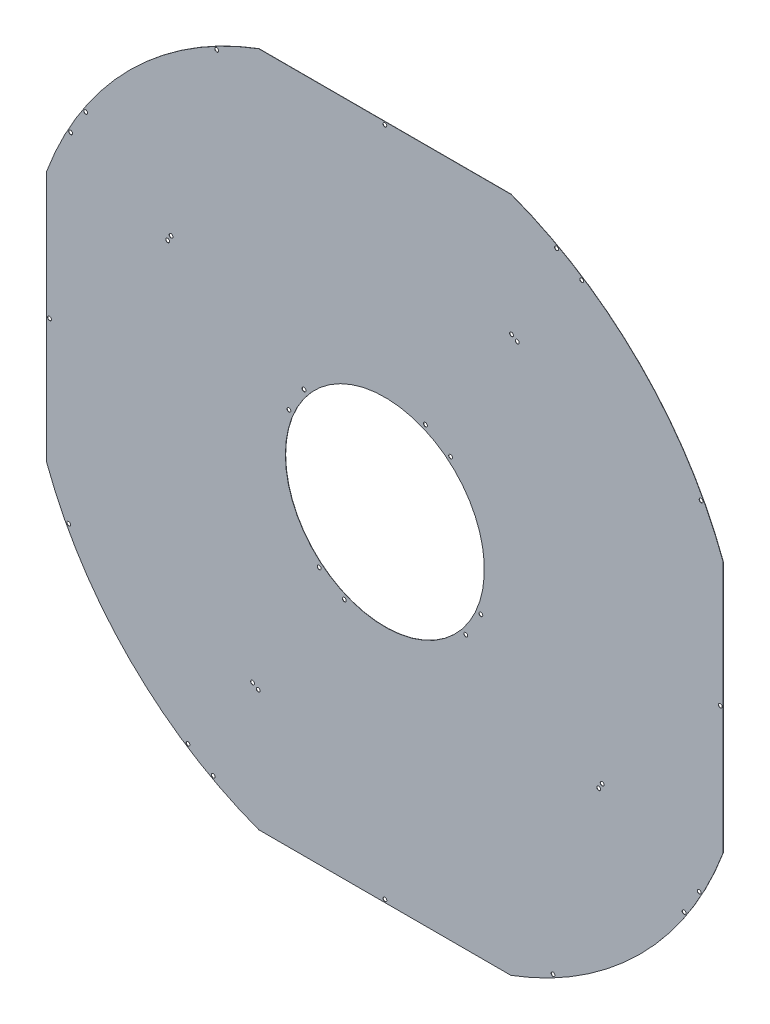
ISO-10303-21;
HEADER;
FILE_DESCRIPTION(('STEP AP214'),'2;1');
FILE_NAME('part.step','',(''),(''),'','','');
FILE_SCHEMA(('AUTOMOTIVE_DESIGN { 1 0 10303 214 1 1 1 1 }'));
ENDSEC;
DATA;
#1=APPLICATION_CONTEXT('core data for automotive mechanical design processes');
#2=APPLICATION_PROTOCOL_DEFINITION('international standard','automotive_design',2000,#1);
#3=PRODUCT_CONTEXT('',#1,'mechanical');
#4=PRODUCT('Part','Part','',(#3));
#5=PRODUCT_RELATED_PRODUCT_CATEGORY('part','',(#4));
#6=PRODUCT_DEFINITION_FORMATION('','',#4);
#7=PRODUCT_DEFINITION_CONTEXT('part definition',#1,'design');
#8=PRODUCT_DEFINITION('design','',#6,#7);
#9=PRODUCT_DEFINITION_SHAPE('','',#8);
#10=(LENGTH_UNIT() NAMED_UNIT(*) SI_UNIT(.MILLI.,.METRE.));
#11=(NAMED_UNIT(*) PLANE_ANGLE_UNIT() SI_UNIT($,.RADIAN.));
#12=(NAMED_UNIT(*) SI_UNIT($,.STERADIAN.) SOLID_ANGLE_UNIT());
#13=UNCERTAINTY_MEASURE_WITH_UNIT(LENGTH_MEASURE(1.E-05),#10,'distance_accuracy_value','');
#14=(GEOMETRIC_REPRESENTATION_CONTEXT(3) GLOBAL_UNCERTAINTY_ASSIGNED_CONTEXT((#13)) GLOBAL_UNIT_ASSIGNED_CONTEXT((#10,
#11,#12)) REPRESENTATION_CONTEXT('',''));
#15=CARTESIAN_POINT('',(0.,0.,0.));
#16=DIRECTION('',(0.,0.,1.));
#17=DIRECTION('',(1.,0.,0.));
#18=AXIS2_PLACEMENT_3D('',#15,#16,#17);
#19=CARTESIAN_POINT('',(0.,0.,0.25));
#20=DIRECTION('',(0.,0.,-1.));
#21=DIRECTION('',(-1.,0.,0.));
#22=AXIS2_PLACEMENT_3D('',#19,#20,#21);
#23=CYLINDRICAL_SURFACE('',#22,381.);
#24=CARTESIAN_POINT('',(0.,0.,0.));
#25=DIRECTION('',(0.,0.,1.));
#26=DIRECTION('',(-1.,0.,0.));
#27=AXIS2_PLACEMENT_3D('',#24,#25,#26);
#28=CIRCLE('',#27,381.);
#29=CARTESIAN_POINT('',(357.000000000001,133.086438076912,0.));
#30=VERTEX_POINT('',#29);
#31=CARTESIAN_POINT('',(133.086438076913,357.,0.));
#32=VERTEX_POINT('',#31);
#33=EDGE_CURVE('E75',#30,#32,#28,.T.);
#34=ORIENTED_EDGE('',*,*,#33,.T.);
#35=DIRECTION('',(0.,0.,-1.));
#36=VECTOR('',#35,1.);
#37=CARTESIAN_POINT('',(133.086438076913,357.,0.25));
#38=LINE('',#37,#36);
#39=CARTESIAN_POINT('',(133.086438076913,357.,0.25));
#40=VERTEX_POINT('',#39);
#41=EDGE_CURVE('E11',#40,#32,#38,.T.);
#42=ORIENTED_EDGE('',*,*,#41,.F.);
#43=CARTESIAN_POINT('',(0.,0.,0.25));
#44=DIRECTION('',(0.,0.,1.));
#45=DIRECTION('',(-1.,0.,0.));
#46=AXIS2_PLACEMENT_3D('',#43,#44,#45);
#47=CIRCLE('',#46,381.);
#48=CARTESIAN_POINT('',(357.000000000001,133.086438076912,0.25));
#49=VERTEX_POINT('',#48);
#50=EDGE_CURVE('E64',#49,#40,#47,.T.);
#51=ORIENTED_EDGE('',*,*,#50,.F.);
#52=DIRECTION('',(0.,0.,-1.));
#53=VECTOR('',#52,1.);
#54=CARTESIAN_POINT('',(357.000000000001,133.086438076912,0.25));
#55=LINE('',#54,#53);
#56=EDGE_CURVE('E87',#49,#30,#55,.T.);
#57=ORIENTED_EDGE('',*,*,#56,.T.);
#58=EDGE_LOOP('',(#34,#42,#51,#57));
#59=FACE_BOUND('',#58,.T.);
#60=ADVANCED_FACE('F30',(#59),#23,.T.);
#61=CARTESIAN_POINT('',(133.086438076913,357.,0.25));
#62=DIRECTION('',(0.,-1.,0.));
#63=DIRECTION('',(1.,0.,0.));
#64=AXIS2_PLACEMENT_3D('',#61,#62,#63);
#65=PLANE('',#64);
#66=DIRECTION('',(-1.,0.,0.));
#67=VECTOR('',#66,1.);
#68=CARTESIAN_POINT('',(133.086438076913,357.,0.));
#69=LINE('',#68,#67);
#70=CARTESIAN_POINT('',(-133.086438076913,357.,0.));
#71=VERTEX_POINT('',#70);
#72=EDGE_CURVE('E57',#32,#71,#69,.T.);
#73=ORIENTED_EDGE('',*,*,#72,.T.);
#74=DIRECTION('',(0.,0.,-1.));
#75=VECTOR('',#74,1.);
#76=CARTESIAN_POINT('',(-133.086438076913,357.,0.25));
#77=LINE('',#76,#75);
#78=CARTESIAN_POINT('',(-133.086438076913,357.,0.25));
#79=VERTEX_POINT('',#78);
#80=EDGE_CURVE('E38',#79,#71,#77,.T.);
#81=ORIENTED_EDGE('',*,*,#80,.F.);
#82=DIRECTION('',(-1.,0.,0.));
#83=VECTOR('',#82,1.);
#84=CARTESIAN_POINT('',(133.086438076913,357.,0.25));
#85=LINE('',#84,#83);
#86=EDGE_CURVE('E46',#40,#79,#85,.T.);
#87=ORIENTED_EDGE('',*,*,#86,.F.);
#88=ORIENTED_EDGE('',*,*,#41,.T.);
#89=EDGE_LOOP('',(#73,#81,#87,#88));
#90=FACE_BOUND('',#89,.T.);
#91=ADVANCED_FACE('F452',(#90),#65,.F.);
#92=CARTESIAN_POINT('',(0.,0.,0.25));
#93=DIRECTION('',(0.,0.,-1.));
#94=DIRECTION('',(-1.,0.,0.));
#95=AXIS2_PLACEMENT_3D('',#92,#93,#94);
#96=CYLINDRICAL_SURFACE('',#95,381.);
#97=CARTESIAN_POINT('',(0.,0.,0.));
#98=DIRECTION('',(0.,0.,1.));
#99=DIRECTION('',(-1.,0.,0.));
#100=AXIS2_PLACEMENT_3D('',#97,#98,#99);
#101=CIRCLE('',#100,381.);
#102=CARTESIAN_POINT('',(-356.999999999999,133.086438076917,0.));
#103=VERTEX_POINT('',#102);
#104=EDGE_CURVE('E156',#71,#103,#101,.T.);
#105=ORIENTED_EDGE('',*,*,#104,.T.);
#106=DIRECTION('',(0.,0.,-1.));
#107=VECTOR('',#106,1.);
#108=CARTESIAN_POINT('',(-356.999999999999,133.086438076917,0.25));
#109=LINE('',#108,#107);
#110=CARTESIAN_POINT('',(-356.999999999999,133.086438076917,0.25));
#111=VERTEX_POINT('',#110);
#112=EDGE_CURVE('E184',#111,#103,#109,.T.);
#113=ORIENTED_EDGE('',*,*,#112,.F.);
#114=CARTESIAN_POINT('',(0.,0.,0.25));
#115=DIRECTION('',(0.,0.,1.));
#116=DIRECTION('',(-1.,0.,0.));
#117=AXIS2_PLACEMENT_3D('',#114,#115,#116);
#118=CIRCLE('',#117,381.);
#119=EDGE_CURVE('E150',#79,#111,#118,.T.);
#120=ORIENTED_EDGE('',*,*,#119,.F.);
#121=ORIENTED_EDGE('',*,*,#80,.T.);
#122=EDGE_LOOP('',(#105,#113,#120,#121));
#123=FACE_BOUND('',#122,.T.);
#124=ADVANCED_FACE('F163',(#123),#96,.T.);
#125=CARTESIAN_POINT('',(0.,0.,0.25));
#126=DIRECTION('',(0.,0.,-1.));
#127=DIRECTION('',(-1.,0.,0.));
#128=AXIS2_PLACEMENT_3D('',#125,#126,#127);
#129=CYLINDRICAL_SURFACE('',#128,105.);
#130=CARTESIAN_POINT('',(0.,0.,0.));
#131=DIRECTION('',(0.,0.,-1.));
#132=DIRECTION('',(-1.,0.,0.));
#133=AXIS2_PLACEMENT_3D('',#130,#131,#132);
#134=CIRCLE('',#133,105.);
#135=CARTESIAN_POINT('',(-105.,0.,0.));
#136=VERTEX_POINT('',#135);
#137=EDGE_CURVE('E148',#136,#136,#134,.T.);
#138=ORIENTED_EDGE('',*,*,#137,.T.);
#139=EDGE_LOOP('',(#138));
#140=FACE_BOUND('',#139,.T.);
#141=CARTESIAN_POINT('',(0.,0.,0.25));
#142=DIRECTION('',(0.,0.,-1.));
#143=DIRECTION('',(-1.,0.,0.));
#144=AXIS2_PLACEMENT_3D('',#141,#142,#143);
#145=CIRCLE('',#144,105.);
#146=CARTESIAN_POINT('',(-105.,0.,0.25));
#147=VERTEX_POINT('',#146);
#148=EDGE_CURVE('E152',#147,#147,#145,.T.);
#149=ORIENTED_EDGE('',*,*,#148,.F.);
#150=EDGE_LOOP('',(#149));
#151=FACE_BOUND('',#150,.T.);
#152=ADVANCED_FACE('F389',(#140,#151),#129,.F.);
#153=CARTESIAN_POINT('',(0.,0.,0.25));
#154=DIRECTION('',(0.,0.,-1.));
#155=DIRECTION('',(-1.,0.,0.));
#156=AXIS2_PLACEMENT_3D('',#153,#154,#155);
#157=PLANE('',#156);
#158=CARTESIAN_POINT('',(-139.694756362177,-225.695502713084,0.25));
#159=DIRECTION('',(0.,0.,1.));
#160=DIRECTION('',(0.,1.,0.));
#161=AXIS2_PLACEMENT_3D('',#158,#159,#160);
#162=CIRCLE('',#161,2.);
#163=CARTESIAN_POINT('',(-139.694756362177,-223.695502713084,0.25));
#164=VERTEX_POINT('',#163);
#165=EDGE_CURVE('E372',#164,#164,#162,.T.);
#166=ORIENTED_EDGE('',*,*,#165,.F.);
#167=EDGE_LOOP('',(#166));
#168=FACE_BOUND('',#167,.T.);
#169=CARTESIAN_POINT('',(-229.300769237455,133.694585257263,0.25));
#170=DIRECTION('',(0.,0.,1.));
#171=DIRECTION('',(0.,1.,0.));
#172=AXIS2_PLACEMENT_3D('',#169,#170,#171);
#173=CIRCLE('',#172,1.99999999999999);
#174=CARTESIAN_POINT('',(-229.300769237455,135.694585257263,0.25));
#175=VERTEX_POINT('',#174);
#176=EDGE_CURVE('E366',#175,#175,#173,.T.);
#177=ORIENTED_EDGE('',*,*,#176,.F.);
#178=EDGE_LOOP('',(#177));
#179=FACE_BOUND('',#178,.T.);
#180=CARTESIAN_POINT('',(-331.719815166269,181.23455582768,0.25));
#181=DIRECTION('',(0.,0.,1.));
#182=DIRECTION('',(0.,1.,0.));
#183=AXIS2_PLACEMENT_3D('',#180,#181,#182);
#184=CIRCLE('',#183,1.99999999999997);
#185=CARTESIAN_POINT('',(-331.719815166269,183.23455582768,0.25));
#186=VERTEX_POINT('',#185);
#187=EDGE_CURVE('E360',#186,#186,#184,.T.);
#188=ORIENTED_EDGE('',*,*,#187,.F.);
#189=EDGE_LOOP('',(#188));
#190=FACE_BOUND('',#189,.T.);
#191=CARTESIAN_POINT('',(-101.330734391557,42.8028301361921,0.25));
#192=DIRECTION('',(0.,0.,1.));
#193=DIRECTION('',(0.,1.,0.));
#194=AXIS2_PLACEMENT_3D('',#191,#192,#193);
#195=CIRCLE('',#194,2.);
#196=CARTESIAN_POINT('',(-101.330734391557,44.8028301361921,0.25));
#197=VERTEX_POINT('',#196);
#198=EDGE_CURVE('E354',#197,#197,#195,.T.);
#199=ORIENTED_EDGE('',*,*,#198,.F.);
#200=EDGE_LOOP('',(#199));
#201=FACE_BOUND('',#200,.T.);
#202=CARTESIAN_POINT('',(-354.,3.65244203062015E-12,0.25));
#203=DIRECTION('',(0.,0.,1.));
#204=DIRECTION('',(0.,1.,0.));
#205=AXIS2_PLACEMENT_3D('',#202,#203,#204);
#206=CIRCLE('',#205,1.99999999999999);
#207=CARTESIAN_POINT('',(-354.,2.00000000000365,0.25));
#208=VERTEX_POINT('',#207);
#209=EDGE_CURVE('E348',#208,#208,#206,.T.);
#210=ORIENTED_EDGE('',*,*,#209,.F.);
#211=EDGE_LOOP('',(#210));
#212=FACE_BOUND('',#211,.T.);
#213=CARTESIAN_POINT('',(-69.3750164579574,-85.3645540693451,0.25));
#214=DIRECTION('',(0.,0.,1.));
#215=DIRECTION('',(0.,1.,0.));
#216=AXIS2_PLACEMENT_3D('',#213,#214,#215);
#217=CIRCLE('',#216,2.00000000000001);
#218=CARTESIAN_POINT('',(-69.3750164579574,-83.3645540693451,0.25));
#219=VERTEX_POINT('',#218);
#220=EDGE_CURVE('E342',#219,#219,#217,.T.);
#221=ORIENTED_EDGE('',*,*,#220,.F.);
#222=EDGE_LOOP('',(#221));
#223=FACE_BOUND('',#222,.T.);
#224=CARTESIAN_POINT('',(-333.754190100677,-177.460250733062,0.25));
#225=DIRECTION('',(0.,0.,1.));
#226=DIRECTION('',(0.,1.,0.));
#227=AXIS2_PLACEMENT_3D('',#224,#225,#226);
#228=CIRCLE('',#227,1.99999999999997);
#229=CARTESIAN_POINT('',(-333.754190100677,-175.460250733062,0.25));
#230=VERTEX_POINT('',#229);
#231=EDGE_CURVE('E336',#230,#230,#228,.T.);
#232=ORIENTED_EDGE('',*,*,#231,.F.);
#233=EDGE_LOOP('',(#232));
#234=FACE_BOUND('',#233,.T.);
#235=CARTESIAN_POINT('',(-207.806742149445,-315.753634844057,0.25));
#236=DIRECTION('',(0.,0.,1.));
#237=DIRECTION('',(0.,1.,0.));
#238=AXIS2_PLACEMENT_3D('',#235,#236,#237);
#239=CIRCLE('',#238,1.99999999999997);
#240=CARTESIAN_POINT('',(-207.806742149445,-313.753634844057,0.25));
#241=VERTEX_POINT('',#240);
#242=EDGE_CURVE('E330',#241,#241,#239,.T.);
#243=ORIENTED_EDGE('',*,*,#242,.F.);
#244=EDGE_LOOP('',(#243));
#245=FACE_BOUND('',#244,.T.);
#246=CARTESIAN_POINT('',(225.695502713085,-139.694756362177,0.25));
#247=DIRECTION('',(0.,0.,1.));
#248=DIRECTION('',(-1.,0.,0.));
#249=AXIS2_PLACEMENT_3D('',#246,#247,#248);
#250=CIRCLE('',#249,2.);
#251=CARTESIAN_POINT('',(223.695502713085,-139.694756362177,0.25));
#252=VERTEX_POINT('',#251);
#253=EDGE_CURVE('E324',#252,#252,#250,.T.);
#254=ORIENTED_EDGE('',*,*,#253,.F.);
#255=EDGE_LOOP('',(#254));
#256=FACE_BOUND('',#255,.T.);
#257=CARTESIAN_POINT('',(-133.694585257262,-229.300769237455,0.25));
#258=DIRECTION('',(0.,0.,1.));
#259=DIRECTION('',(-1.,0.,0.));
#260=AXIS2_PLACEMENT_3D('',#257,#258,#259);
#261=CIRCLE('',#260,1.99999999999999);
#262=CARTESIAN_POINT('',(-135.694585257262,-229.300769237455,0.25));
#263=VERTEX_POINT('',#262);
#264=EDGE_CURVE('E318',#263,#263,#261,.T.);
#265=ORIENTED_EDGE('',*,*,#264,.F.);
#266=EDGE_LOOP('',(#265));
#267=FACE_BOUND('',#266,.T.);
#268=CARTESIAN_POINT('',(-181.234555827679,-331.71981516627,0.25));
#269=DIRECTION('',(0.,0.,1.));
#270=DIRECTION('',(-1.,0.,0.));
#271=AXIS2_PLACEMENT_3D('',#268,#269,#270);
#272=CIRCLE('',#271,1.99999999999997);
#273=CARTESIAN_POINT('',(-183.234555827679,-331.71981516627,0.25));
#274=VERTEX_POINT('',#273);
#275=EDGE_CURVE('E312',#274,#274,#272,.T.);
#276=ORIENTED_EDGE('',*,*,#275,.F.);
#277=EDGE_LOOP('',(#276));
#278=FACE_BOUND('',#277,.T.);
#279=CARTESIAN_POINT('',(-42.8028301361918,-101.330734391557,0.25));
#280=DIRECTION('',(0.,0.,1.));
#281=DIRECTION('',(-1.,0.,0.));
#282=AXIS2_PLACEMENT_3D('',#279,#280,#281);
#283=CIRCLE('',#282,2.);
#284=CARTESIAN_POINT('',(-44.8028301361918,-101.330734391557,0.25));
#285=VERTEX_POINT('',#284);
#286=EDGE_CURVE('E306',#285,#285,#283,.T.);
#287=ORIENTED_EDGE('',*,*,#286,.F.);
#288=EDGE_LOOP('',(#287));
#289=FACE_BOUND('',#288,.T.);
#290=CARTESIAN_POINT('',(-2.41645763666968E-12,-354.,0.25));
#291=DIRECTION('',(0.,0.,1.));
#292=DIRECTION('',(-1.,0.,0.));
#293=AXIS2_PLACEMENT_3D('',#290,#291,#292);
#294=CIRCLE('',#293,1.99999999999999);
#295=CARTESIAN_POINT('',(-2.00000000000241,-354.,0.25));
#296=VERTEX_POINT('',#295);
#297=EDGE_CURVE('E300',#296,#296,#294,.T.);
#298=ORIENTED_EDGE('',*,*,#297,.F.);
#299=EDGE_LOOP('',(#298));
#300=FACE_BOUND('',#299,.T.);
#301=CARTESIAN_POINT('',(85.3645540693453,-69.3750164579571,0.25));
#302=DIRECTION('',(0.,0.,1.));
#303=DIRECTION('',(-1.,0.,0.));
#304=AXIS2_PLACEMENT_3D('',#301,#302,#303);
#305=CIRCLE('',#304,2.00000000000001);
#306=CARTESIAN_POINT('',(83.3645540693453,-69.3750164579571,0.25));
#307=VERTEX_POINT('',#306);
#308=EDGE_CURVE('E294',#307,#307,#305,.T.);
#309=ORIENTED_EDGE('',*,*,#308,.F.);
#310=EDGE_LOOP('',(#309));
#311=FACE_BOUND('',#310,.T.);
#312=CARTESIAN_POINT('',(177.460250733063,-333.754190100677,0.25));
#313=DIRECTION('',(0.,0.,1.));
#314=DIRECTION('',(-1.,0.,0.));
#315=AXIS2_PLACEMENT_3D('',#312,#313,#314);
#316=CIRCLE('',#315,1.99999999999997);
#317=CARTESIAN_POINT('',(175.460250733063,-333.754190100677,0.25));
#318=VERTEX_POINT('',#317);
#319=EDGE_CURVE('E288',#318,#318,#316,.T.);
#320=ORIENTED_EDGE('',*,*,#319,.F.);
#321=EDGE_LOOP('',(#320));
#322=FACE_BOUND('',#321,.T.);
#323=CARTESIAN_POINT('',(315.753634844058,-207.806742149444,0.25));
#324=DIRECTION('',(0.,0.,1.));
#325=DIRECTION('',(-1.,0.,0.));
#326=AXIS2_PLACEMENT_3D('',#323,#324,#325);
#327=CIRCLE('',#326,1.99999999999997);
#328=CARTESIAN_POINT('',(313.753634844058,-207.806742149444,0.25));
#329=VERTEX_POINT('',#328);
#330=EDGE_CURVE('E282',#329,#329,#327,.T.);
#331=ORIENTED_EDGE('',*,*,#330,.F.);
#332=EDGE_LOOP('',(#331));
#333=FACE_BOUND('',#332,.T.);
#334=CARTESIAN_POINT('',(139.694756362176,225.695502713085,0.25));
#335=DIRECTION('',(0.,0.,1.));
#336=DIRECTION('',(0.,-1.,0.));
#337=AXIS2_PLACEMENT_3D('',#334,#335,#336);
#338=CIRCLE('',#337,2.);
#339=CARTESIAN_POINT('',(139.694756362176,223.695502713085,0.25));
#340=VERTEX_POINT('',#339);
#341=EDGE_CURVE('E276',#340,#340,#338,.T.);
#342=ORIENTED_EDGE('',*,*,#341,.F.);
#343=EDGE_LOOP('',(#342));
#344=FACE_BOUND('',#343,.T.);
#345=CARTESIAN_POINT('',(229.300769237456,-133.694585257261,0.25));
#346=DIRECTION('',(0.,0.,1.));
#347=DIRECTION('',(0.,-1.,0.));
#348=AXIS2_PLACEMENT_3D('',#345,#346,#347);
#349=CIRCLE('',#348,1.99999999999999);
#350=CARTESIAN_POINT('',(229.300769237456,-135.694585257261,0.25));
#351=VERTEX_POINT('',#350);
#352=EDGE_CURVE('E270',#351,#351,#349,.T.);
#353=ORIENTED_EDGE('',*,*,#352,.F.);
#354=EDGE_LOOP('',(#353));
#355=FACE_BOUND('',#354,.T.);
#356=CARTESIAN_POINT('',(331.71981516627,-181.234555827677,0.25));
#357=DIRECTION('',(0.,0.,1.));
#358=DIRECTION('',(0.,-1.,0.));
#359=AXIS2_PLACEMENT_3D('',#356,#357,#358);
#360=CIRCLE('',#359,1.99999999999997);
#361=CARTESIAN_POINT('',(331.71981516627,-183.234555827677,0.25));
#362=VERTEX_POINT('',#361);
#363=EDGE_CURVE('E264',#362,#362,#360,.T.);
#364=ORIENTED_EDGE('',*,*,#363,.F.);
#365=EDGE_LOOP('',(#364));
#366=FACE_BOUND('',#365,.T.);
#367=CARTESIAN_POINT('',(101.330734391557,-42.8028301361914,0.25));
#368=DIRECTION('',(0.,0.,1.));
#369=DIRECTION('',(0.,-1.,0.));
#370=AXIS2_PLACEMENT_3D('',#367,#368,#369);
#371=CIRCLE('',#370,2.);
#372=CARTESIAN_POINT('',(101.330734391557,-44.8028301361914,0.25));
#373=VERTEX_POINT('',#372);
#374=EDGE_CURVE('E258',#373,#373,#371,.T.);
#375=ORIENTED_EDGE('',*,*,#374,.F.);
#376=EDGE_LOOP('',(#375));
#377=FACE_BOUND('',#376,.T.);
#378=CARTESIAN_POINT('',(354.,-1.18047324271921E-12,0.25));
#379=DIRECTION('',(0.,0.,1.));
#380=DIRECTION('',(0.,-1.,0.));
#381=AXIS2_PLACEMENT_3D('',#378,#379,#380);
#382=CIRCLE('',#381,1.99999999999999);
#383=CARTESIAN_POINT('',(354.,-2.00000000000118,0.25));
#384=VERTEX_POINT('',#383);
#385=EDGE_CURVE('E252',#384,#384,#382,.T.);
#386=ORIENTED_EDGE('',*,*,#385,.F.);
#387=EDGE_LOOP('',(#386));
#388=FACE_BOUND('',#387,.T.);
#389=CARTESIAN_POINT('',(69.3750164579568,85.3645540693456,0.25));
#390=DIRECTION('',(0.,0.,1.));
#391=DIRECTION('',(0.,-1.,0.));
#392=AXIS2_PLACEMENT_3D('',#389,#390,#391);
#393=CIRCLE('',#392,2.00000000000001);
#394=CARTESIAN_POINT('',(69.3750164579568,83.3645540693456,0.25));
#395=VERTEX_POINT('',#394);
#396=EDGE_CURVE('E246',#395,#395,#393,.T.);
#397=ORIENTED_EDGE('',*,*,#396,.F.);
#398=EDGE_LOOP('',(#397));
#399=FACE_BOUND('',#398,.T.);
#400=CARTESIAN_POINT('',(333.754190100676,177.460250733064,0.25));
#401=DIRECTION('',(0.,0.,1.));
#402=DIRECTION('',(0.,-1.,0.));
#403=AXIS2_PLACEMENT_3D('',#400,#401,#402);
#404=CIRCLE('',#403,1.99999999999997);
#405=CARTESIAN_POINT('',(333.754190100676,175.460250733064,0.25));
#406=VERTEX_POINT('',#405);
#407=EDGE_CURVE('E240',#406,#406,#404,.T.);
#408=ORIENTED_EDGE('',*,*,#407,.F.);
#409=EDGE_LOOP('',(#408));
#410=FACE_BOUND('',#409,.T.);
#411=CARTESIAN_POINT('',(207.806742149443,315.753634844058,0.25));
#412=DIRECTION('',(0.,0.,1.));
#413=DIRECTION('',(0.,-1.,0.));
#414=AXIS2_PLACEMENT_3D('',#411,#412,#413);
#415=CIRCLE('',#414,1.99999999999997);
#416=CARTESIAN_POINT('',(207.806742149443,313.753634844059,0.25));
#417=VERTEX_POINT('',#416);
#418=EDGE_CURVE('E234',#417,#417,#415,.T.);
#419=ORIENTED_EDGE('',*,*,#418,.F.);
#420=EDGE_LOOP('',(#419));
#421=FACE_BOUND('',#420,.T.);
#422=DIRECTION('',(0.,1.,0.));
#423=VECTOR('',#422,1.);
#424=CARTESIAN_POINT('',(357.,-133.086438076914,0.25));
#425=LINE('',#424,#423);
#426=CARTESIAN_POINT('',(357.,-133.086438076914,0.25));
#427=VERTEX_POINT('',#426);
#428=EDGE_CURVE('E94',#427,#49,#425,.T.);
#429=ORIENTED_EDGE('',*,*,#428,.T.);
#430=ORIENTED_EDGE('',*,*,#50,.T.);
#431=ORIENTED_EDGE('',*,*,#86,.T.);
#432=ORIENTED_EDGE('',*,*,#119,.T.);
#433=DIRECTION('',(0.,-1.,0.));
#434=VECTOR('',#433,1.);
#435=CARTESIAN_POINT('',(-356.999999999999,133.086438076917,0.25));
#436=LINE('',#435,#434);
#437=CARTESIAN_POINT('',(-357.000000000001,-133.086438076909,0.25));
#438=VERTEX_POINT('',#437);
#439=EDGE_CURVE('E180',#111,#438,#436,.T.);
#440=ORIENTED_EDGE('',*,*,#439,.T.);
#441=CARTESIAN_POINT('',(0.,0.,0.25));
#442=DIRECTION('',(0.,0.,1.));
#443=DIRECTION('',(1.,0.,0.));
#444=AXIS2_PLACEMENT_3D('',#441,#442,#443);
#445=CIRCLE('',#444,381.);
#446=CARTESIAN_POINT('',(-133.086438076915,-356.999999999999,0.25));
#447=VERTEX_POINT('',#446);
#448=EDGE_CURVE('E194',#438,#447,#445,.T.);
#449=ORIENTED_EDGE('',*,*,#448,.T.);
#450=DIRECTION('',(1.,0.,0.));
#451=VECTOR('',#450,1.);
#452=CARTESIAN_POINT('',(-133.086438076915,-356.999999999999,0.25));
#453=LINE('',#452,#451);
#454=CARTESIAN_POINT('',(133.08643807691,-357.000000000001,0.25));
#455=VERTEX_POINT('',#454);
#456=EDGE_CURVE('E197',#447,#455,#453,.T.);
#457=ORIENTED_EDGE('',*,*,#456,.T.);
#458=CARTESIAN_POINT('',(0.,0.,0.25));
#459=DIRECTION('',(0.,0.,1.));
#460=DIRECTION('',(0.,1.,0.));
#461=AXIS2_PLACEMENT_3D('',#458,#459,#460);
#462=CIRCLE('',#461,381.);
#463=EDGE_CURVE('E91',#455,#427,#462,.T.);
#464=ORIENTED_EDGE('',*,*,#463,.T.);
#465=EDGE_LOOP('',(#429,#430,#431,#432,#440,#449,#457,#464));
#466=FACE_BOUND('',#465,.T.);
#467=CARTESIAN_POINT('',(-225.695502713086,139.694756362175,0.25));
#468=DIRECTION('',(0.,0.,1.));
#469=DIRECTION('',(1.,0.,0.));
#470=AXIS2_PLACEMENT_3D('',#467,#468,#469);
#471=CIRCLE('',#470,2.);
#472=CARTESIAN_POINT('',(-223.695502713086,139.694756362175,0.25));
#473=VERTEX_POINT('',#472);
#474=EDGE_CURVE('E96',#473,#473,#471,.T.);
#475=ORIENTED_EDGE('',*,*,#474,.F.);
#476=EDGE_LOOP('',(#475));
#477=FACE_BOUND('',#476,.T.);
#478=CARTESIAN_POINT('',(133.69458525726,229.300769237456,0.25));
#479=DIRECTION('',(0.,0.,1.));
#480=DIRECTION('',(1.,0.,0.));
#481=AXIS2_PLACEMENT_3D('',#478,#479,#480);
#482=CIRCLE('',#481,1.99999999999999);
#483=CARTESIAN_POINT('',(135.69458525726,229.300769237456,0.25));
#484=VERTEX_POINT('',#483);
#485=EDGE_CURVE('E104',#484,#484,#482,.T.);
#486=ORIENTED_EDGE('',*,*,#485,.F.);
#487=EDGE_LOOP('',(#486));
#488=FACE_BOUND('',#487,.T.);
#489=CARTESIAN_POINT('',(181.234555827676,331.719815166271,0.25));
#490=DIRECTION('',(0.,0.,1.));
#491=DIRECTION('',(1.,0.,0.));
#492=AXIS2_PLACEMENT_3D('',#489,#490,#491);
#493=CIRCLE('',#492,1.99999999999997);
#494=CARTESIAN_POINT('',(183.234555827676,331.719815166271,0.25));
#495=VERTEX_POINT('',#494);
#496=EDGE_CURVE('E110',#495,#495,#493,.T.);
#497=ORIENTED_EDGE('',*,*,#496,.F.);
#498=EDGE_LOOP('',(#497));
#499=FACE_BOUND('',#498,.T.);
#500=CARTESIAN_POINT('',(42.8028301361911,101.330734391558,0.25));
#501=DIRECTION('',(0.,0.,1.));
#502=DIRECTION('',(1.,0.,0.));
#503=AXIS2_PLACEMENT_3D('',#500,#501,#502);
#504=CIRCLE('',#503,2.);
#505=CARTESIAN_POINT('',(44.8028301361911,101.330734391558,0.25));
#506=VERTEX_POINT('',#505);
#507=EDGE_CURVE('E116',#506,#506,#504,.T.);
#508=ORIENTED_EDGE('',*,*,#507,.F.);
#509=EDGE_LOOP('',(#508));
#510=FACE_BOUND('',#509,.T.);
#511=CARTESIAN_POINT('',(0.,354.,0.25));
#512=DIRECTION('',(0.,0.,1.));
#513=DIRECTION('',(1.,0.,0.));
#514=AXIS2_PLACEMENT_3D('',#511,#512,#513);
#515=CIRCLE('',#514,1.99999999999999);
#516=CARTESIAN_POINT('',(1.99999999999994,354.,0.25));
#517=VERTEX_POINT('',#516);
#518=EDGE_CURVE('E122',#517,#517,#515,.T.);
#519=ORIENTED_EDGE('',*,*,#518,.F.);
#520=EDGE_LOOP('',(#519));
#521=FACE_BOUND('',#520,.T.);
#522=CARTESIAN_POINT('',(-85.3645540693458,69.3750164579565,0.25));
#523=DIRECTION('',(0.,0.,1.));
#524=DIRECTION('',(1.,0.,0.));
#525=AXIS2_PLACEMENT_3D('',#522,#523,#524);
#526=CIRCLE('',#525,2.00000000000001);
#527=CARTESIAN_POINT('',(-83.3645540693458,69.3750164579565,0.25));
#528=VERTEX_POINT('',#527);
#529=EDGE_CURVE('E128',#528,#528,#526,.T.);
#530=ORIENTED_EDGE('',*,*,#529,.F.);
#531=EDGE_LOOP('',(#530));
#532=FACE_BOUND('',#531,.T.);
#533=CARTESIAN_POINT('',(-177.460250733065,333.754190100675,0.25));
#534=DIRECTION('',(0.,0.,1.));
#535=DIRECTION('',(1.,0.,0.));
#536=AXIS2_PLACEMENT_3D('',#533,#534,#535);
#537=CIRCLE('',#536,1.99999999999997);
#538=CARTESIAN_POINT('',(-175.460250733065,333.754190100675,0.25));
#539=VERTEX_POINT('',#538);
#540=EDGE_CURVE('E134',#539,#539,#537,.T.);
#541=ORIENTED_EDGE('',*,*,#540,.F.);
#542=EDGE_LOOP('',(#541));
#543=FACE_BOUND('',#542,.T.);
#544=CARTESIAN_POINT('',(-315.753634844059,207.806742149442,0.25));
#545=DIRECTION('',(0.,0.,1.));
#546=DIRECTION('',(1.,0.,0.));
#547=AXIS2_PLACEMENT_3D('',#544,#545,#546);
#548=CIRCLE('',#547,1.99999999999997);
#549=CARTESIAN_POINT('',(-313.753634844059,207.806742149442,0.25));
#550=VERTEX_POINT('',#549);
#551=EDGE_CURVE('E140',#550,#550,#548,.T.);
#552=ORIENTED_EDGE('',*,*,#551,.F.);
#553=EDGE_LOOP('',(#552));
#554=FACE_BOUND('',#553,.T.);
#555=ORIENTED_EDGE('',*,*,#148,.T.);
#556=EDGE_LOOP('',(#555));
#557=FACE_BOUND('',#556,.T.);
#558=ADVANCED_FACE('F230',(#168,#179,#190,#201,#212,#223,#234,#245,#256,#267,#278,#289,#300,
#311,#322,#333,#344,#355,#366,#377,#388,#399,#410,#421,#466,#477,#488,#499,#510,#521,#532,#543,
#554,#557),#157,.F.);
#559=CARTESIAN_POINT('',(0.,0.,0.));
#560=DIRECTION('',(0.,0.,-1.));
#561=DIRECTION('',(-1.,0.,0.));
#562=AXIS2_PLACEMENT_3D('',#559,#560,#561);
#563=PLANE('',#562);
#564=CARTESIAN_POINT('',(-139.694756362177,-225.695502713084,0.));
#565=DIRECTION('',(0.,0.,1.));
#566=DIRECTION('',(0.,1.,0.));
#567=AXIS2_PLACEMENT_3D('',#564,#565,#566);
#568=CIRCLE('',#567,2.);
#569=CARTESIAN_POINT('',(-139.694756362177,-223.695502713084,0.));
#570=VERTEX_POINT('',#569);
#571=EDGE_CURVE('E369',#570,#570,#568,.T.);
#572=ORIENTED_EDGE('',*,*,#571,.T.);
#573=EDGE_LOOP('',(#572));
#574=FACE_BOUND('',#573,.T.);
#575=CARTESIAN_POINT('',(-229.300769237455,133.694585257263,0.));
#576=DIRECTION('',(0.,0.,1.));
#577=DIRECTION('',(0.,1.,0.));
#578=AXIS2_PLACEMENT_3D('',#575,#576,#577);
#579=CIRCLE('',#578,1.99999999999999);
#580=CARTESIAN_POINT('',(-229.300769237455,135.694585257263,0.));
#581=VERTEX_POINT('',#580);
#582=EDGE_CURVE('E363',#581,#581,#579,.T.);
#583=ORIENTED_EDGE('',*,*,#582,.T.);
#584=EDGE_LOOP('',(#583));
#585=FACE_BOUND('',#584,.T.);
#586=CARTESIAN_POINT('',(-331.719815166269,181.23455582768,0.));
#587=DIRECTION('',(0.,0.,1.));
#588=DIRECTION('',(0.,1.,0.));
#589=AXIS2_PLACEMENT_3D('',#586,#587,#588);
#590=CIRCLE('',#589,1.99999999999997);
#591=CARTESIAN_POINT('',(-331.719815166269,183.23455582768,0.));
#592=VERTEX_POINT('',#591);
#593=EDGE_CURVE('E357',#592,#592,#590,.T.);
#594=ORIENTED_EDGE('',*,*,#593,.T.);
#595=EDGE_LOOP('',(#594));
#596=FACE_BOUND('',#595,.T.);
#597=CARTESIAN_POINT('',(-101.330734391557,42.8028301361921,0.));
#598=DIRECTION('',(0.,0.,1.));
#599=DIRECTION('',(0.,1.,0.));
#600=AXIS2_PLACEMENT_3D('',#597,#598,#599);
#601=CIRCLE('',#600,2.);
#602=CARTESIAN_POINT('',(-101.330734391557,44.8028301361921,0.));
#603=VERTEX_POINT('',#602);
#604=EDGE_CURVE('E351',#603,#603,#601,.T.);
#605=ORIENTED_EDGE('',*,*,#604,.T.);
#606=EDGE_LOOP('',(#605));
#607=FACE_BOUND('',#606,.T.);
#608=CARTESIAN_POINT('',(-354.,3.65244203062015E-12,0.));
#609=DIRECTION('',(0.,0.,1.));
#610=DIRECTION('',(0.,1.,0.));
#611=AXIS2_PLACEMENT_3D('',#608,#609,#610);
#612=CIRCLE('',#611,1.99999999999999);
#613=CARTESIAN_POINT('',(-354.,2.00000000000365,0.));
#614=VERTEX_POINT('',#613);
#615=EDGE_CURVE('E345',#614,#614,#612,.T.);
#616=ORIENTED_EDGE('',*,*,#615,.T.);
#617=EDGE_LOOP('',(#616));
#618=FACE_BOUND('',#617,.T.);
#619=CARTESIAN_POINT('',(-69.3750164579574,-85.3645540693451,0.));
#620=DIRECTION('',(0.,0.,1.));
#621=DIRECTION('',(0.,1.,0.));
#622=AXIS2_PLACEMENT_3D('',#619,#620,#621);
#623=CIRCLE('',#622,2.00000000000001);
#624=CARTESIAN_POINT('',(-69.3750164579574,-83.3645540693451,0.));
#625=VERTEX_POINT('',#624);
#626=EDGE_CURVE('E339',#625,#625,#623,.T.);
#627=ORIENTED_EDGE('',*,*,#626,.T.);
#628=EDGE_LOOP('',(#627));
#629=FACE_BOUND('',#628,.T.);
#630=CARTESIAN_POINT('',(-333.754190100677,-177.460250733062,0.));
#631=DIRECTION('',(0.,0.,1.));
#632=DIRECTION('',(0.,1.,0.));
#633=AXIS2_PLACEMENT_3D('',#630,#631,#632);
#634=CIRCLE('',#633,1.99999999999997);
#635=CARTESIAN_POINT('',(-333.754190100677,-175.460250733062,0.));
#636=VERTEX_POINT('',#635);
#637=EDGE_CURVE('E333',#636,#636,#634,.T.);
#638=ORIENTED_EDGE('',*,*,#637,.T.);
#639=EDGE_LOOP('',(#638));
#640=FACE_BOUND('',#639,.T.);
#641=CARTESIAN_POINT('',(-207.806742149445,-315.753634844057,0.));
#642=DIRECTION('',(0.,0.,1.));
#643=DIRECTION('',(0.,1.,0.));
#644=AXIS2_PLACEMENT_3D('',#641,#642,#643);
#645=CIRCLE('',#644,1.99999999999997);
#646=CARTESIAN_POINT('',(-207.806742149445,-313.753634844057,0.));
#647=VERTEX_POINT('',#646);
#648=EDGE_CURVE('E327',#647,#647,#645,.T.);
#649=ORIENTED_EDGE('',*,*,#648,.T.);
#650=EDGE_LOOP('',(#649));
#651=FACE_BOUND('',#650,.T.);
#652=CARTESIAN_POINT('',(225.695502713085,-139.694756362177,0.));
#653=DIRECTION('',(0.,0.,1.));
#654=DIRECTION('',(-1.,0.,0.));
#655=AXIS2_PLACEMENT_3D('',#652,#653,#654);
#656=CIRCLE('',#655,2.);
#657=CARTESIAN_POINT('',(223.695502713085,-139.694756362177,0.));
#658=VERTEX_POINT('',#657);
#659=EDGE_CURVE('E321',#658,#658,#656,.T.);
#660=ORIENTED_EDGE('',*,*,#659,.T.);
#661=EDGE_LOOP('',(#660));
#662=FACE_BOUND('',#661,.T.);
#663=CARTESIAN_POINT('',(-133.694585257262,-229.300769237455,0.));
#664=DIRECTION('',(0.,0.,1.));
#665=DIRECTION('',(-1.,0.,0.));
#666=AXIS2_PLACEMENT_3D('',#663,#664,#665);
#667=CIRCLE('',#666,1.99999999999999);
#668=CARTESIAN_POINT('',(-135.694585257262,-229.300769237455,0.));
#669=VERTEX_POINT('',#668);
#670=EDGE_CURVE('E315',#669,#669,#667,.T.);
#671=ORIENTED_EDGE('',*,*,#670,.T.);
#672=EDGE_LOOP('',(#671));
#673=FACE_BOUND('',#672,.T.);
#674=CARTESIAN_POINT('',(-181.234555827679,-331.71981516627,0.));
#675=DIRECTION('',(0.,0.,1.));
#676=DIRECTION('',(-1.,0.,0.));
#677=AXIS2_PLACEMENT_3D('',#674,#675,#676);
#678=CIRCLE('',#677,1.99999999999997);
#679=CARTESIAN_POINT('',(-183.234555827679,-331.71981516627,0.));
#680=VERTEX_POINT('',#679);
#681=EDGE_CURVE('E309',#680,#680,#678,.T.);
#682=ORIENTED_EDGE('',*,*,#681,.T.);
#683=EDGE_LOOP('',(#682));
#684=FACE_BOUND('',#683,.T.);
#685=CARTESIAN_POINT('',(-42.8028301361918,-101.330734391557,0.));
#686=DIRECTION('',(0.,0.,1.));
#687=DIRECTION('',(-1.,0.,0.));
#688=AXIS2_PLACEMENT_3D('',#685,#686,#687);
#689=CIRCLE('',#688,2.);
#690=CARTESIAN_POINT('',(-44.8028301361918,-101.330734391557,0.));
#691=VERTEX_POINT('',#690);
#692=EDGE_CURVE('E303',#691,#691,#689,.T.);
#693=ORIENTED_EDGE('',*,*,#692,.T.);
#694=EDGE_LOOP('',(#693));
#695=FACE_BOUND('',#694,.T.);
#696=CARTESIAN_POINT('',(-2.41645763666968E-12,-354.,0.));
#697=DIRECTION('',(0.,0.,1.));
#698=DIRECTION('',(-1.,0.,0.));
#699=AXIS2_PLACEMENT_3D('',#696,#697,#698);
#700=CIRCLE('',#699,1.99999999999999);
#701=CARTESIAN_POINT('',(-2.00000000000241,-354.,0.));
#702=VERTEX_POINT('',#701);
#703=EDGE_CURVE('E297',#702,#702,#700,.T.);
#704=ORIENTED_EDGE('',*,*,#703,.T.);
#705=EDGE_LOOP('',(#704));
#706=FACE_BOUND('',#705,.T.);
#707=CARTESIAN_POINT('',(85.3645540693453,-69.3750164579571,0.));
#708=DIRECTION('',(0.,0.,1.));
#709=DIRECTION('',(-1.,0.,0.));
#710=AXIS2_PLACEMENT_3D('',#707,#708,#709);
#711=CIRCLE('',#710,2.00000000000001);
#712=CARTESIAN_POINT('',(83.3645540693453,-69.3750164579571,0.));
#713=VERTEX_POINT('',#712);
#714=EDGE_CURVE('E291',#713,#713,#711,.T.);
#715=ORIENTED_EDGE('',*,*,#714,.T.);
#716=EDGE_LOOP('',(#715));
#717=FACE_BOUND('',#716,.T.);
#718=CARTESIAN_POINT('',(177.460250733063,-333.754190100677,0.));
#719=DIRECTION('',(0.,0.,1.));
#720=DIRECTION('',(-1.,0.,0.));
#721=AXIS2_PLACEMENT_3D('',#718,#719,#720);
#722=CIRCLE('',#721,1.99999999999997);
#723=CARTESIAN_POINT('',(175.460250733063,-333.754190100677,0.));
#724=VERTEX_POINT('',#723);
#725=EDGE_CURVE('E285',#724,#724,#722,.T.);
#726=ORIENTED_EDGE('',*,*,#725,.T.);
#727=EDGE_LOOP('',(#726));
#728=FACE_BOUND('',#727,.T.);
#729=CARTESIAN_POINT('',(315.753634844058,-207.806742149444,0.));
#730=DIRECTION('',(0.,0.,1.));
#731=DIRECTION('',(-1.,0.,0.));
#732=AXIS2_PLACEMENT_3D('',#729,#730,#731);
#733=CIRCLE('',#732,1.99999999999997);
#734=CARTESIAN_POINT('',(313.753634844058,-207.806742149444,0.));
#735=VERTEX_POINT('',#734);
#736=EDGE_CURVE('E279',#735,#735,#733,.T.);
#737=ORIENTED_EDGE('',*,*,#736,.T.);
#738=EDGE_LOOP('',(#737));
#739=FACE_BOUND('',#738,.T.);
#740=CARTESIAN_POINT('',(139.694756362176,225.695502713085,0.));
#741=DIRECTION('',(0.,0.,1.));
#742=DIRECTION('',(0.,-1.,0.));
#743=AXIS2_PLACEMENT_3D('',#740,#741,#742);
#744=CIRCLE('',#743,2.);
#745=CARTESIAN_POINT('',(139.694756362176,223.695502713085,0.));
#746=VERTEX_POINT('',#745);
#747=EDGE_CURVE('E273',#746,#746,#744,.T.);
#748=ORIENTED_EDGE('',*,*,#747,.T.);
#749=EDGE_LOOP('',(#748));
#750=FACE_BOUND('',#749,.T.);
#751=CARTESIAN_POINT('',(229.300769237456,-133.694585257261,0.));
#752=DIRECTION('',(0.,0.,1.));
#753=DIRECTION('',(0.,-1.,0.));
#754=AXIS2_PLACEMENT_3D('',#751,#752,#753);
#755=CIRCLE('',#754,1.99999999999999);
#756=CARTESIAN_POINT('',(229.300769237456,-135.694585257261,0.));
#757=VERTEX_POINT('',#756);
#758=EDGE_CURVE('E267',#757,#757,#755,.T.);
#759=ORIENTED_EDGE('',*,*,#758,.T.);
#760=EDGE_LOOP('',(#759));
#761=FACE_BOUND('',#760,.T.);
#762=CARTESIAN_POINT('',(331.71981516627,-181.234555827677,0.));
#763=DIRECTION('',(0.,0.,1.));
#764=DIRECTION('',(0.,-1.,0.));
#765=AXIS2_PLACEMENT_3D('',#762,#763,#764);
#766=CIRCLE('',#765,1.99999999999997);
#767=CARTESIAN_POINT('',(331.71981516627,-183.234555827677,0.));
#768=VERTEX_POINT('',#767);
#769=EDGE_CURVE('E261',#768,#768,#766,.T.);
#770=ORIENTED_EDGE('',*,*,#769,.T.);
#771=EDGE_LOOP('',(#770));
#772=FACE_BOUND('',#771,.T.);
#773=CARTESIAN_POINT('',(101.330734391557,-42.8028301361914,0.));
#774=DIRECTION('',(0.,0.,1.));
#775=DIRECTION('',(0.,-1.,0.));
#776=AXIS2_PLACEMENT_3D('',#773,#774,#775);
#777=CIRCLE('',#776,2.);
#778=CARTESIAN_POINT('',(101.330734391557,-44.8028301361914,0.));
#779=VERTEX_POINT('',#778);
#780=EDGE_CURVE('E255',#779,#779,#777,.T.);
#781=ORIENTED_EDGE('',*,*,#780,.T.);
#782=EDGE_LOOP('',(#781));
#783=FACE_BOUND('',#782,.T.);
#784=CARTESIAN_POINT('',(354.,-1.18047324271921E-12,0.));
#785=DIRECTION('',(0.,0.,1.));
#786=DIRECTION('',(0.,-1.,0.));
#787=AXIS2_PLACEMENT_3D('',#784,#785,#786);
#788=CIRCLE('',#787,1.99999999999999);
#789=CARTESIAN_POINT('',(354.,-2.00000000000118,0.));
#790=VERTEX_POINT('',#789);
#791=EDGE_CURVE('E249',#790,#790,#788,.T.);
#792=ORIENTED_EDGE('',*,*,#791,.T.);
#793=EDGE_LOOP('',(#792));
#794=FACE_BOUND('',#793,.T.);
#795=CARTESIAN_POINT('',(69.3750164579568,85.3645540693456,0.));
#796=DIRECTION('',(0.,0.,1.));
#797=DIRECTION('',(0.,-1.,0.));
#798=AXIS2_PLACEMENT_3D('',#795,#796,#797);
#799=CIRCLE('',#798,2.00000000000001);
#800=CARTESIAN_POINT('',(69.3750164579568,83.3645540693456,0.));
#801=VERTEX_POINT('',#800);
#802=EDGE_CURVE('E243',#801,#801,#799,.T.);
#803=ORIENTED_EDGE('',*,*,#802,.T.);
#804=EDGE_LOOP('',(#803));
#805=FACE_BOUND('',#804,.T.);
#806=CARTESIAN_POINT('',(333.754190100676,177.460250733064,0.));
#807=DIRECTION('',(0.,0.,1.));
#808=DIRECTION('',(0.,-1.,0.));
#809=AXIS2_PLACEMENT_3D('',#806,#807,#808);
#810=CIRCLE('',#809,1.99999999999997);
#811=CARTESIAN_POINT('',(333.754190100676,175.460250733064,0.));
#812=VERTEX_POINT('',#811);
#813=EDGE_CURVE('E237',#812,#812,#810,.T.);
#814=ORIENTED_EDGE('',*,*,#813,.T.);
#815=EDGE_LOOP('',(#814));
#816=FACE_BOUND('',#815,.T.);
#817=CARTESIAN_POINT('',(207.806742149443,315.753634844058,0.));
#818=DIRECTION('',(0.,0.,1.));
#819=DIRECTION('',(0.,-1.,0.));
#820=AXIS2_PLACEMENT_3D('',#817,#818,#819);
#821=CIRCLE('',#820,1.99999999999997);
#822=CARTESIAN_POINT('',(207.806742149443,313.753634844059,0.));
#823=VERTEX_POINT('',#822);
#824=EDGE_CURVE('E181',#823,#823,#821,.T.);
#825=ORIENTED_EDGE('',*,*,#824,.T.);
#826=EDGE_LOOP('',(#825));
#827=FACE_BOUND('',#826,.T.);
#828=ORIENTED_EDGE('',*,*,#33,.F.);
#829=DIRECTION('',(0.,1.,0.));
#830=VECTOR('',#829,1.);
#831=CARTESIAN_POINT('',(357.,-133.086438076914,0.));
#832=LINE('',#831,#830);
#833=CARTESIAN_POINT('',(357.,-133.086438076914,0.));
#834=VERTEX_POINT('',#833);
#835=EDGE_CURVE('E80',#834,#30,#832,.T.);
#836=ORIENTED_EDGE('',*,*,#835,.F.);
#837=CARTESIAN_POINT('',(0.,0.,0.));
#838=DIRECTION('',(0.,0.,1.));
#839=DIRECTION('',(0.,1.,0.));
#840=AXIS2_PLACEMENT_3D('',#837,#838,#839);
#841=CIRCLE('',#840,381.);
#842=CARTESIAN_POINT('',(133.08643807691,-357.000000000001,0.));
#843=VERTEX_POINT('',#842);
#844=EDGE_CURVE('E92',#843,#834,#841,.T.);
#845=ORIENTED_EDGE('',*,*,#844,.F.);
#846=DIRECTION('',(1.,0.,0.));
#847=VECTOR('',#846,1.);
#848=CARTESIAN_POINT('',(-133.086438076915,-356.999999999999,0.));
#849=LINE('',#848,#847);
#850=CARTESIAN_POINT('',(-133.086438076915,-356.999999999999,0.));
#851=VERTEX_POINT('',#850);
#852=EDGE_CURVE('E190',#851,#843,#849,.T.);
#853=ORIENTED_EDGE('',*,*,#852,.F.);
#854=CARTESIAN_POINT('',(0.,0.,0.));
#855=DIRECTION('',(0.,0.,1.));
#856=DIRECTION('',(1.,0.,0.));
#857=AXIS2_PLACEMENT_3D('',#854,#855,#856);
#858=CIRCLE('',#857,381.);
#859=CARTESIAN_POINT('',(-357.000000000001,-133.086438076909,0.));
#860=VERTEX_POINT('',#859);
#861=EDGE_CURVE('E175',#860,#851,#858,.T.);
#862=ORIENTED_EDGE('',*,*,#861,.F.);
#863=DIRECTION('',(0.,-1.,0.));
#864=VECTOR('',#863,1.);
#865=CARTESIAN_POINT('',(-356.999999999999,133.086438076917,0.));
#866=LINE('',#865,#864);
#867=EDGE_CURVE('E170',#103,#860,#866,.T.);
#868=ORIENTED_EDGE('',*,*,#867,.F.);
#869=ORIENTED_EDGE('',*,*,#104,.F.);
#870=ORIENTED_EDGE('',*,*,#72,.F.);
#871=EDGE_LOOP('',(#828,#836,#845,#853,#862,#868,#869,#870));
#872=FACE_BOUND('',#871,.T.);
#873=CARTESIAN_POINT('',(-225.695502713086,139.694756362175,0.));
#874=DIRECTION('',(0.,0.,1.));
#875=DIRECTION('',(1.,0.,0.));
#876=AXIS2_PLACEMENT_3D('',#873,#874,#875);
#877=CIRCLE('',#876,2.);
#878=CARTESIAN_POINT('',(-223.695502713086,139.694756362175,0.));
#879=VERTEX_POINT('',#878);
#880=EDGE_CURVE('E101',#879,#879,#877,.T.);
#881=ORIENTED_EDGE('',*,*,#880,.T.);
#882=EDGE_LOOP('',(#881));
#883=FACE_BOUND('',#882,.T.);
#884=CARTESIAN_POINT('',(133.69458525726,229.300769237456,0.));
#885=DIRECTION('',(0.,0.,1.));
#886=DIRECTION('',(1.,0.,0.));
#887=AXIS2_PLACEMENT_3D('',#884,#885,#886);
#888=CIRCLE('',#887,1.99999999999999);
#889=CARTESIAN_POINT('',(135.69458525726,229.300769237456,0.));
#890=VERTEX_POINT('',#889);
#891=EDGE_CURVE('E107',#890,#890,#888,.T.);
#892=ORIENTED_EDGE('',*,*,#891,.T.);
#893=EDGE_LOOP('',(#892));
#894=FACE_BOUND('',#893,.T.);
#895=CARTESIAN_POINT('',(181.234555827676,331.719815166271,0.));
#896=DIRECTION('',(0.,0.,1.));
#897=DIRECTION('',(1.,0.,0.));
#898=AXIS2_PLACEMENT_3D('',#895,#896,#897);
#899=CIRCLE('',#898,1.99999999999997);
#900=CARTESIAN_POINT('',(183.234555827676,331.719815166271,0.));
#901=VERTEX_POINT('',#900);
#902=EDGE_CURVE('E113',#901,#901,#899,.T.);
#903=ORIENTED_EDGE('',*,*,#902,.T.);
#904=EDGE_LOOP('',(#903));
#905=FACE_BOUND('',#904,.T.);
#906=CARTESIAN_POINT('',(42.8028301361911,101.330734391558,0.));
#907=DIRECTION('',(0.,0.,1.));
#908=DIRECTION('',(1.,0.,0.));
#909=AXIS2_PLACEMENT_3D('',#906,#907,#908);
#910=CIRCLE('',#909,2.);
#911=CARTESIAN_POINT('',(44.8028301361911,101.330734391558,0.));
#912=VERTEX_POINT('',#911);
#913=EDGE_CURVE('E119',#912,#912,#910,.T.);
#914=ORIENTED_EDGE('',*,*,#913,.T.);
#915=EDGE_LOOP('',(#914));
#916=FACE_BOUND('',#915,.T.);
#917=CARTESIAN_POINT('',(0.,354.,0.));
#918=DIRECTION('',(0.,0.,1.));
#919=DIRECTION('',(1.,0.,0.));
#920=AXIS2_PLACEMENT_3D('',#917,#918,#919);
#921=CIRCLE('',#920,1.99999999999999);
#922=CARTESIAN_POINT('',(1.99999999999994,354.,0.));
#923=VERTEX_POINT('',#922);
#924=EDGE_CURVE('E125',#923,#923,#921,.T.);
#925=ORIENTED_EDGE('',*,*,#924,.T.);
#926=EDGE_LOOP('',(#925));
#927=FACE_BOUND('',#926,.T.);
#928=CARTESIAN_POINT('',(-85.3645540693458,69.3750164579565,0.));
#929=DIRECTION('',(0.,0.,1.));
#930=DIRECTION('',(1.,0.,0.));
#931=AXIS2_PLACEMENT_3D('',#928,#929,#930);
#932=CIRCLE('',#931,2.00000000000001);
#933=CARTESIAN_POINT('',(-83.3645540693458,69.3750164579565,0.));
#934=VERTEX_POINT('',#933);
#935=EDGE_CURVE('E131',#934,#934,#932,.T.);
#936=ORIENTED_EDGE('',*,*,#935,.T.);
#937=EDGE_LOOP('',(#936));
#938=FACE_BOUND('',#937,.T.);
#939=CARTESIAN_POINT('',(-177.460250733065,333.754190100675,0.));
#940=DIRECTION('',(0.,0.,1.));
#941=DIRECTION('',(1.,0.,0.));
#942=AXIS2_PLACEMENT_3D('',#939,#940,#941);
#943=CIRCLE('',#942,1.99999999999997);
#944=CARTESIAN_POINT('',(-175.460250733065,333.754190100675,0.));
#945=VERTEX_POINT('',#944);
#946=EDGE_CURVE('E137',#945,#945,#943,.T.);
#947=ORIENTED_EDGE('',*,*,#946,.T.);
#948=EDGE_LOOP('',(#947));
#949=FACE_BOUND('',#948,.T.);
#950=CARTESIAN_POINT('',(-315.753634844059,207.806742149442,0.));
#951=DIRECTION('',(0.,0.,1.));
#952=DIRECTION('',(1.,0.,0.));
#953=AXIS2_PLACEMENT_3D('',#950,#951,#952);
#954=CIRCLE('',#953,1.99999999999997);
#955=CARTESIAN_POINT('',(-313.753634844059,207.806742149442,0.));
#956=VERTEX_POINT('',#955);
#957=EDGE_CURVE('E82',#956,#956,#954,.T.);
#958=ORIENTED_EDGE('',*,*,#957,.T.);
#959=EDGE_LOOP('',(#958));
#960=FACE_BOUND('',#959,.T.);
#961=ORIENTED_EDGE('',*,*,#137,.F.);
#962=EDGE_LOOP('',(#961));
#963=FACE_BOUND('',#962,.T.);
#964=ADVANCED_FACE('F77',(#574,#585,#596,#607,#618,#629,#640,#651,#662,#673,#684,#695,#706,#717,
#728,#739,#750,#761,#772,#783,#794,#805,#816,#827,#872,#883,#894,#905,#916,#927,#938,#949,#960,
#963),#563,.T.);
#965=CARTESIAN_POINT('',(-315.753634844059,207.806742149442,0.));
#966=DIRECTION('',(0.,0.,1.));
#967=DIRECTION('',(1.,0.,0.));
#968=AXIS2_PLACEMENT_3D('',#965,#966,#967);
#969=CYLINDRICAL_SURFACE('',#968,1.99999999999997);
#970=ORIENTED_EDGE('',*,*,#957,.F.);
#971=EDGE_LOOP('',(#970));
#972=FACE_BOUND('',#971,.T.);
#973=ORIENTED_EDGE('',*,*,#551,.T.);
#974=EDGE_LOOP('',(#973));
#975=FACE_BOUND('',#974,.T.);
#976=ADVANCED_FACE('F465',(#972,#975),#969,.F.);
#977=CARTESIAN_POINT('',(-177.460250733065,333.754190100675,0.));
#978=DIRECTION('',(0.,0.,1.));
#979=DIRECTION('',(1.,0.,0.));
#980=AXIS2_PLACEMENT_3D('',#977,#978,#979);
#981=CYLINDRICAL_SURFACE('',#980,1.99999999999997);
#982=ORIENTED_EDGE('',*,*,#946,.F.);
#983=EDGE_LOOP('',(#982));
#984=FACE_BOUND('',#983,.T.);
#985=ORIENTED_EDGE('',*,*,#540,.T.);
#986=EDGE_LOOP('',(#985));
#987=FACE_BOUND('',#986,.T.);
#988=ADVANCED_FACE('F469',(#984,#987),#981,.F.);
#989=CARTESIAN_POINT('',(-85.3645540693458,69.3750164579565,0.));
#990=DIRECTION('',(0.,0.,1.));
#991=DIRECTION('',(1.,0.,0.));
#992=AXIS2_PLACEMENT_3D('',#989,#990,#991);
#993=CYLINDRICAL_SURFACE('',#992,2.00000000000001);
#994=ORIENTED_EDGE('',*,*,#935,.F.);
#995=EDGE_LOOP('',(#994));
#996=FACE_BOUND('',#995,.T.);
#997=ORIENTED_EDGE('',*,*,#529,.T.);
#998=EDGE_LOOP('',(#997));
#999=FACE_BOUND('',#998,.T.);
#1000=ADVANCED_FACE('F473',(#996,#999),#993,.F.);
#1001=CARTESIAN_POINT('',(0.,354.,0.));
#1002=DIRECTION('',(0.,0.,1.));
#1003=DIRECTION('',(1.,0.,0.));
#1004=AXIS2_PLACEMENT_3D('',#1001,#1002,#1003);
#1005=CYLINDRICAL_SURFACE('',#1004,1.99999999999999);
#1006=ORIENTED_EDGE('',*,*,#924,.F.);
#1007=EDGE_LOOP('',(#1006));
#1008=FACE_BOUND('',#1007,.T.);
#1009=ORIENTED_EDGE('',*,*,#518,.T.);
#1010=EDGE_LOOP('',(#1009));
#1011=FACE_BOUND('',#1010,.T.);
#1012=ADVANCED_FACE('F477',(#1008,#1011),#1005,.F.);
#1013=CARTESIAN_POINT('',(42.8028301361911,101.330734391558,0.));
#1014=DIRECTION('',(0.,0.,1.));
#1015=DIRECTION('',(1.,0.,0.));
#1016=AXIS2_PLACEMENT_3D('',#1013,#1014,#1015);
#1017=CYLINDRICAL_SURFACE('',#1016,2.);
#1018=ORIENTED_EDGE('',*,*,#913,.F.);
#1019=EDGE_LOOP('',(#1018));
#1020=FACE_BOUND('',#1019,.T.);
#1021=ORIENTED_EDGE('',*,*,#507,.T.);
#1022=EDGE_LOOP('',(#1021));
#1023=FACE_BOUND('',#1022,.T.);
#1024=ADVANCED_FACE('F481',(#1020,#1023),#1017,.F.);
#1025=CARTESIAN_POINT('',(181.234555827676,331.719815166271,0.));
#1026=DIRECTION('',(0.,0.,1.));
#1027=DIRECTION('',(1.,0.,0.));
#1028=AXIS2_PLACEMENT_3D('',#1025,#1026,#1027);
#1029=CYLINDRICAL_SURFACE('',#1028,1.99999999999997);
#1030=ORIENTED_EDGE('',*,*,#902,.F.);
#1031=EDGE_LOOP('',(#1030));
#1032=FACE_BOUND('',#1031,.T.);
#1033=ORIENTED_EDGE('',*,*,#496,.T.);
#1034=EDGE_LOOP('',(#1033));
#1035=FACE_BOUND('',#1034,.T.);
#1036=ADVANCED_FACE('F485',(#1032,#1035),#1029,.F.);
#1037=CARTESIAN_POINT('',(133.69458525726,229.300769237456,0.));
#1038=DIRECTION('',(0.,0.,1.));
#1039=DIRECTION('',(1.,0.,0.));
#1040=AXIS2_PLACEMENT_3D('',#1037,#1038,#1039);
#1041=CYLINDRICAL_SURFACE('',#1040,1.99999999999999);
#1042=ORIENTED_EDGE('',*,*,#891,.F.);
#1043=EDGE_LOOP('',(#1042));
#1044=FACE_BOUND('',#1043,.T.);
#1045=ORIENTED_EDGE('',*,*,#485,.T.);
#1046=EDGE_LOOP('',(#1045));
#1047=FACE_BOUND('',#1046,.T.);
#1048=ADVANCED_FACE('F489',(#1044,#1047),#1041,.F.);
#1049=CARTESIAN_POINT('',(-225.695502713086,139.694756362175,0.));
#1050=DIRECTION('',(0.,0.,1.));
#1051=DIRECTION('',(1.,0.,0.));
#1052=AXIS2_PLACEMENT_3D('',#1049,#1050,#1051);
#1053=CYLINDRICAL_SURFACE('',#1052,2.);
#1054=ORIENTED_EDGE('',*,*,#880,.F.);
#1055=EDGE_LOOP('',(#1054));
#1056=FACE_BOUND('',#1055,.T.);
#1057=ORIENTED_EDGE('',*,*,#474,.T.);
#1058=EDGE_LOOP('',(#1057));
#1059=FACE_BOUND('',#1058,.T.);
#1060=ADVANCED_FACE('F493',(#1056,#1059),#1053,.F.);
#1061=CARTESIAN_POINT('',(0.,0.,0.25));
#1062=DIRECTION('',(0.,0.,-1.));
#1063=DIRECTION('',(-1.,0.,0.));
#1064=AXIS2_PLACEMENT_3D('',#1061,#1062,#1063);
#1065=CYLINDRICAL_SURFACE('',#1064,381.);
#1066=ORIENTED_EDGE('',*,*,#844,.T.);
#1067=DIRECTION('',(0.,0.,-1.));
#1068=VECTOR('',#1067,1.);
#1069=CARTESIAN_POINT('',(357.,-133.086438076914,0.25));
#1070=LINE('',#1069,#1068);
#1071=EDGE_CURVE('E89',#427,#834,#1070,.T.);
#1072=ORIENTED_EDGE('',*,*,#1071,.F.);
#1073=ORIENTED_EDGE('',*,*,#463,.F.);
#1074=DIRECTION('',(0.,0.,-1.));
#1075=VECTOR('',#1074,1.);
#1076=CARTESIAN_POINT('',(133.08643807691,-357.000000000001,0.25));
#1077=LINE('',#1076,#1075);
#1078=EDGE_CURVE('E199',#455,#843,#1077,.T.);
#1079=ORIENTED_EDGE('',*,*,#1078,.T.);
#1080=EDGE_LOOP('',(#1066,#1072,#1073,#1079));
#1081=FACE_BOUND('',#1080,.T.);
#1082=ADVANCED_FACE('F210',(#1081),#1065,.T.);
#1083=CARTESIAN_POINT('',(357.,-133.086438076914,0.25));
#1084=DIRECTION('',(-1.,0.,0.));
#1085=DIRECTION('',(0.,-1.,0.));
#1086=AXIS2_PLACEMENT_3D('',#1083,#1084,#1085);
#1087=PLANE('',#1086);
#1088=ORIENTED_EDGE('',*,*,#835,.T.);
#1089=ORIENTED_EDGE('',*,*,#56,.F.);
#1090=ORIENTED_EDGE('',*,*,#428,.F.);
#1091=ORIENTED_EDGE('',*,*,#1071,.T.);
#1092=EDGE_LOOP('',(#1088,#1089,#1090,#1091));
#1093=FACE_BOUND('',#1092,.T.);
#1094=ADVANCED_FACE('F86',(#1093),#1087,.F.);
#1095=CARTESIAN_POINT('',(0.,0.,0.25));
#1096=DIRECTION('',(0.,0.,-1.));
#1097=DIRECTION('',(-1.,0.,0.));
#1098=AXIS2_PLACEMENT_3D('',#1095,#1096,#1097);
#1099=CYLINDRICAL_SURFACE('',#1098,381.);
#1100=ORIENTED_EDGE('',*,*,#861,.T.);
#1101=DIRECTION('',(0.,0.,-1.));
#1102=VECTOR('',#1101,1.);
#1103=CARTESIAN_POINT('',(-133.086438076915,-356.999999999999,0.25));
#1104=LINE('',#1103,#1102);
#1105=EDGE_CURVE('E205',#447,#851,#1104,.T.);
#1106=ORIENTED_EDGE('',*,*,#1105,.F.);
#1107=ORIENTED_EDGE('',*,*,#448,.F.);
#1108=DIRECTION('',(0.,0.,-1.));
#1109=VECTOR('',#1108,1.);
#1110=CARTESIAN_POINT('',(-357.000000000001,-133.086438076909,0.25));
#1111=LINE('',#1110,#1109);
#1112=EDGE_CURVE('E188',#438,#860,#1111,.T.);
#1113=ORIENTED_EDGE('',*,*,#1112,.T.);
#1114=EDGE_LOOP('',(#1100,#1106,#1107,#1113));
#1115=FACE_BOUND('',#1114,.T.);
#1116=ADVANCED_FACE('F224',(#1115),#1099,.T.);
#1117=CARTESIAN_POINT('',(-133.086438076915,-356.999999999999,0.25));
#1118=DIRECTION('',(0.,1.,0.));
#1119=DIRECTION('',(-1.,0.,0.));
#1120=AXIS2_PLACEMENT_3D('',#1117,#1118,#1119);
#1121=PLANE('',#1120);
#1122=ORIENTED_EDGE('',*,*,#852,.T.);
#1123=ORIENTED_EDGE('',*,*,#1078,.F.);
#1124=ORIENTED_EDGE('',*,*,#456,.F.);
#1125=ORIENTED_EDGE('',*,*,#1105,.T.);
#1126=EDGE_LOOP('',(#1122,#1123,#1124,#1125));
#1127=FACE_BOUND('',#1126,.T.);
#1128=ADVANCED_FACE('F217',(#1127),#1121,.F.);
#1129=CARTESIAN_POINT('',(-356.999999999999,133.086438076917,0.25));
#1130=DIRECTION('',(1.,0.,0.));
#1131=DIRECTION('',(0.,1.,0.));
#1132=AXIS2_PLACEMENT_3D('',#1129,#1130,#1131);
#1133=PLANE('',#1132);
#1134=ORIENTED_EDGE('',*,*,#867,.T.);
#1135=ORIENTED_EDGE('',*,*,#1112,.F.);
#1136=ORIENTED_EDGE('',*,*,#439,.F.);
#1137=ORIENTED_EDGE('',*,*,#112,.T.);
#1138=EDGE_LOOP('',(#1134,#1135,#1136,#1137));
#1139=FACE_BOUND('',#1138,.T.);
#1140=ADVANCED_FACE('F185',(#1139),#1133,.F.);
#1141=CARTESIAN_POINT('',(207.806742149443,315.753634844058,0.));
#1142=DIRECTION('',(0.,0.,1.));
#1143=DIRECTION('',(1.,0.,0.));
#1144=AXIS2_PLACEMENT_3D('',#1141,#1142,#1143);
#1145=CYLINDRICAL_SURFACE('',#1144,1.99999999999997);
#1146=ORIENTED_EDGE('',*,*,#824,.F.);
#1147=EDGE_LOOP('',(#1146));
#1148=FACE_BOUND('',#1147,.T.);
#1149=ORIENTED_EDGE('',*,*,#418,.T.);
#1150=EDGE_LOOP('',(#1149));
#1151=FACE_BOUND('',#1150,.T.);
#1152=ADVANCED_FACE('F437',(#1148,#1151),#1145,.F.);
#1153=CARTESIAN_POINT('',(333.754190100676,177.460250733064,0.));
#1154=DIRECTION('',(0.,0.,1.));
#1155=DIRECTION('',(1.,0.,0.));
#1156=AXIS2_PLACEMENT_3D('',#1153,#1154,#1155);
#1157=CYLINDRICAL_SURFACE('',#1156,1.99999999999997);
#1158=ORIENTED_EDGE('',*,*,#813,.F.);
#1159=EDGE_LOOP('',(#1158));
#1160=FACE_BOUND('',#1159,.T.);
#1161=ORIENTED_EDGE('',*,*,#407,.T.);
#1162=EDGE_LOOP('',(#1161));
#1163=FACE_BOUND('',#1162,.T.);
#1164=ADVANCED_FACE('F439',(#1160,#1163),#1157,.F.);
#1165=CARTESIAN_POINT('',(69.3750164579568,85.3645540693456,0.));
#1166=DIRECTION('',(0.,0.,1.));
#1167=DIRECTION('',(1.,0.,0.));
#1168=AXIS2_PLACEMENT_3D('',#1165,#1166,#1167);
#1169=CYLINDRICAL_SURFACE('',#1168,2.00000000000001);
#1170=ORIENTED_EDGE('',*,*,#802,.F.);
#1171=EDGE_LOOP('',(#1170));
#1172=FACE_BOUND('',#1171,.T.);
#1173=ORIENTED_EDGE('',*,*,#396,.T.);
#1174=EDGE_LOOP('',(#1173));
#1175=FACE_BOUND('',#1174,.T.);
#1176=ADVANCED_FACE('F446',(#1172,#1175),#1169,.F.);
#1177=CARTESIAN_POINT('',(354.,-1.18047324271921E-12,0.));
#1178=DIRECTION('',(0.,0.,1.));
#1179=DIRECTION('',(1.,0.,0.));
#1180=AXIS2_PLACEMENT_3D('',#1177,#1178,#1179);
#1181=CYLINDRICAL_SURFACE('',#1180,1.99999999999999);
#1182=ORIENTED_EDGE('',*,*,#791,.F.);
#1183=EDGE_LOOP('',(#1182));
#1184=FACE_BOUND('',#1183,.T.);
#1185=ORIENTED_EDGE('',*,*,#385,.T.);
#1186=EDGE_LOOP('',(#1185));
#1187=FACE_BOUND('',#1186,.T.);
#1188=ADVANCED_FACE('F532',(#1184,#1187),#1181,.F.);
#1189=CARTESIAN_POINT('',(101.330734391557,-42.8028301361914,0.));
#1190=DIRECTION('',(0.,0.,1.));
#1191=DIRECTION('',(1.,0.,0.));
#1192=AXIS2_PLACEMENT_3D('',#1189,#1190,#1191);
#1193=CYLINDRICAL_SURFACE('',#1192,2.);
#1194=ORIENTED_EDGE('',*,*,#780,.F.);
#1195=EDGE_LOOP('',(#1194));
#1196=FACE_BOUND('',#1195,.T.);
#1197=ORIENTED_EDGE('',*,*,#374,.T.);
#1198=EDGE_LOOP('',(#1197));
#1199=FACE_BOUND('',#1198,.T.);
#1200=ADVANCED_FACE('F542',(#1196,#1199),#1193,.F.);
#1201=CARTESIAN_POINT('',(331.71981516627,-181.234555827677,0.));
#1202=DIRECTION('',(0.,0.,1.));
#1203=DIRECTION('',(1.,0.,0.));
#1204=AXIS2_PLACEMENT_3D('',#1201,#1202,#1203);
#1205=CYLINDRICAL_SURFACE('',#1204,1.99999999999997);
#1206=ORIENTED_EDGE('',*,*,#769,.F.);
#1207=EDGE_LOOP('',(#1206));
#1208=FACE_BOUND('',#1207,.T.);
#1209=ORIENTED_EDGE('',*,*,#363,.T.);
#1210=EDGE_LOOP('',(#1209));
#1211=FACE_BOUND('',#1210,.T.);
#1212=ADVANCED_FACE('F552',(#1208,#1211),#1205,.F.);
#1213=CARTESIAN_POINT('',(229.300769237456,-133.694585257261,0.));
#1214=DIRECTION('',(0.,0.,1.));
#1215=DIRECTION('',(1.,0.,0.));
#1216=AXIS2_PLACEMENT_3D('',#1213,#1214,#1215);
#1217=CYLINDRICAL_SURFACE('',#1216,1.99999999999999);
#1218=ORIENTED_EDGE('',*,*,#758,.F.);
#1219=EDGE_LOOP('',(#1218));
#1220=FACE_BOUND('',#1219,.T.);
#1221=ORIENTED_EDGE('',*,*,#352,.T.);
#1222=EDGE_LOOP('',(#1221));
#1223=FACE_BOUND('',#1222,.T.);
#1224=ADVANCED_FACE('F562',(#1220,#1223),#1217,.F.);
#1225=CARTESIAN_POINT('',(139.694756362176,225.695502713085,0.));
#1226=DIRECTION('',(0.,0.,1.));
#1227=DIRECTION('',(1.,0.,0.));
#1228=AXIS2_PLACEMENT_3D('',#1225,#1226,#1227);
#1229=CYLINDRICAL_SURFACE('',#1228,2.);
#1230=ORIENTED_EDGE('',*,*,#747,.F.);
#1231=EDGE_LOOP('',(#1230));
#1232=FACE_BOUND('',#1231,.T.);
#1233=ORIENTED_EDGE('',*,*,#341,.T.);
#1234=EDGE_LOOP('',(#1233));
#1235=FACE_BOUND('',#1234,.T.);
#1236=ADVANCED_FACE('F572',(#1232,#1235),#1229,.F.);
#1237=CARTESIAN_POINT('',(315.753634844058,-207.806742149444,0.));
#1238=DIRECTION('',(0.,0.,1.));
#1239=DIRECTION('',(1.,0.,0.));
#1240=AXIS2_PLACEMENT_3D('',#1237,#1238,#1239);
#1241=CYLINDRICAL_SURFACE('',#1240,1.99999999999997);
#1242=ORIENTED_EDGE('',*,*,#736,.F.);
#1243=EDGE_LOOP('',(#1242));
#1244=FACE_BOUND('',#1243,.T.);
#1245=ORIENTED_EDGE('',*,*,#330,.T.);
#1246=EDGE_LOOP('',(#1245));
#1247=FACE_BOUND('',#1246,.T.);
#1248=ADVANCED_FACE('F582',(#1244,#1247),#1241,.F.);
#1249=CARTESIAN_POINT('',(177.460250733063,-333.754190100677,0.));
#1250=DIRECTION('',(0.,0.,1.));
#1251=DIRECTION('',(1.,0.,0.));
#1252=AXIS2_PLACEMENT_3D('',#1249,#1250,#1251);
#1253=CYLINDRICAL_SURFACE('',#1252,1.99999999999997);
#1254=ORIENTED_EDGE('',*,*,#725,.F.);
#1255=EDGE_LOOP('',(#1254));
#1256=FACE_BOUND('',#1255,.T.);
#1257=ORIENTED_EDGE('',*,*,#319,.T.);
#1258=EDGE_LOOP('',(#1257));
#1259=FACE_BOUND('',#1258,.T.);
#1260=ADVANCED_FACE('F592',(#1256,#1259),#1253,.F.);
#1261=CARTESIAN_POINT('',(85.3645540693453,-69.3750164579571,0.));
#1262=DIRECTION('',(0.,0.,1.));
#1263=DIRECTION('',(1.,0.,0.));
#1264=AXIS2_PLACEMENT_3D('',#1261,#1262,#1263);
#1265=CYLINDRICAL_SURFACE('',#1264,2.00000000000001);
#1266=ORIENTED_EDGE('',*,*,#714,.F.);
#1267=EDGE_LOOP('',(#1266));
#1268=FACE_BOUND('',#1267,.T.);
#1269=ORIENTED_EDGE('',*,*,#308,.T.);
#1270=EDGE_LOOP('',(#1269));
#1271=FACE_BOUND('',#1270,.T.);
#1272=ADVANCED_FACE('F602',(#1268,#1271),#1265,.F.);
#1273=CARTESIAN_POINT('',(-2.41645763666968E-12,-354.,0.));
#1274=DIRECTION('',(0.,0.,1.));
#1275=DIRECTION('',(1.,0.,0.));
#1276=AXIS2_PLACEMENT_3D('',#1273,#1274,#1275);
#1277=CYLINDRICAL_SURFACE('',#1276,1.99999999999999);
#1278=ORIENTED_EDGE('',*,*,#703,.F.);
#1279=EDGE_LOOP('',(#1278));
#1280=FACE_BOUND('',#1279,.T.);
#1281=ORIENTED_EDGE('',*,*,#297,.T.);
#1282=EDGE_LOOP('',(#1281));
#1283=FACE_BOUND('',#1282,.T.);
#1284=ADVANCED_FACE('F612',(#1280,#1283),#1277,.F.);
#1285=CARTESIAN_POINT('',(-42.8028301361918,-101.330734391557,0.));
#1286=DIRECTION('',(0.,0.,1.));
#1287=DIRECTION('',(1.,0.,0.));
#1288=AXIS2_PLACEMENT_3D('',#1285,#1286,#1287);
#1289=CYLINDRICAL_SURFACE('',#1288,2.);
#1290=ORIENTED_EDGE('',*,*,#692,.F.);
#1291=EDGE_LOOP('',(#1290));
#1292=FACE_BOUND('',#1291,.T.);
#1293=ORIENTED_EDGE('',*,*,#286,.T.);
#1294=EDGE_LOOP('',(#1293));
#1295=FACE_BOUND('',#1294,.T.);
#1296=ADVANCED_FACE('F622',(#1292,#1295),#1289,.F.);
#1297=CARTESIAN_POINT('',(-181.234555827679,-331.71981516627,0.));
#1298=DIRECTION('',(0.,0.,1.));
#1299=DIRECTION('',(1.,0.,0.));
#1300=AXIS2_PLACEMENT_3D('',#1297,#1298,#1299);
#1301=CYLINDRICAL_SURFACE('',#1300,1.99999999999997);
#1302=ORIENTED_EDGE('',*,*,#681,.F.);
#1303=EDGE_LOOP('',(#1302));
#1304=FACE_BOUND('',#1303,.T.);
#1305=ORIENTED_EDGE('',*,*,#275,.T.);
#1306=EDGE_LOOP('',(#1305));
#1307=FACE_BOUND('',#1306,.T.);
#1308=ADVANCED_FACE('F632',(#1304,#1307),#1301,.F.);
#1309=CARTESIAN_POINT('',(-133.694585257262,-229.300769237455,0.));
#1310=DIRECTION('',(0.,0.,1.));
#1311=DIRECTION('',(1.,0.,0.));
#1312=AXIS2_PLACEMENT_3D('',#1309,#1310,#1311);
#1313=CYLINDRICAL_SURFACE('',#1312,1.99999999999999);
#1314=ORIENTED_EDGE('',*,*,#670,.F.);
#1315=EDGE_LOOP('',(#1314));
#1316=FACE_BOUND('',#1315,.T.);
#1317=ORIENTED_EDGE('',*,*,#264,.T.);
#1318=EDGE_LOOP('',(#1317));
#1319=FACE_BOUND('',#1318,.T.);
#1320=ADVANCED_FACE('F642',(#1316,#1319),#1313,.F.);
#1321=CARTESIAN_POINT('',(225.695502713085,-139.694756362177,0.));
#1322=DIRECTION('',(0.,0.,1.));
#1323=DIRECTION('',(1.,0.,0.));
#1324=AXIS2_PLACEMENT_3D('',#1321,#1322,#1323);
#1325=CYLINDRICAL_SURFACE('',#1324,2.);
#1326=ORIENTED_EDGE('',*,*,#659,.F.);
#1327=EDGE_LOOP('',(#1326));
#1328=FACE_BOUND('',#1327,.T.);
#1329=ORIENTED_EDGE('',*,*,#253,.T.);
#1330=EDGE_LOOP('',(#1329));
#1331=FACE_BOUND('',#1330,.T.);
#1332=ADVANCED_FACE('F652',(#1328,#1331),#1325,.F.);
#1333=CARTESIAN_POINT('',(-207.806742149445,-315.753634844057,0.));
#1334=DIRECTION('',(0.,0.,1.));
#1335=DIRECTION('',(1.,0.,0.));
#1336=AXIS2_PLACEMENT_3D('',#1333,#1334,#1335);
#1337=CYLINDRICAL_SURFACE('',#1336,1.99999999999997);
#1338=ORIENTED_EDGE('',*,*,#648,.F.);
#1339=EDGE_LOOP('',(#1338));
#1340=FACE_BOUND('',#1339,.T.);
#1341=ORIENTED_EDGE('',*,*,#242,.T.);
#1342=EDGE_LOOP('',(#1341));
#1343=FACE_BOUND('',#1342,.T.);
#1344=ADVANCED_FACE('F662',(#1340,#1343),#1337,.F.);
#1345=CARTESIAN_POINT('',(-333.754190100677,-177.460250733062,0.));
#1346=DIRECTION('',(0.,0.,1.));
#1347=DIRECTION('',(1.,0.,0.));
#1348=AXIS2_PLACEMENT_3D('',#1345,#1346,#1347);
#1349=CYLINDRICAL_SURFACE('',#1348,1.99999999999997);
#1350=ORIENTED_EDGE('',*,*,#637,.F.);
#1351=EDGE_LOOP('',(#1350));
#1352=FACE_BOUND('',#1351,.T.);
#1353=ORIENTED_EDGE('',*,*,#231,.T.);
#1354=EDGE_LOOP('',(#1353));
#1355=FACE_BOUND('',#1354,.T.);
#1356=ADVANCED_FACE('F672',(#1352,#1355),#1349,.F.);
#1357=CARTESIAN_POINT('',(-69.3750164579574,-85.3645540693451,0.));
#1358=DIRECTION('',(0.,0.,1.));
#1359=DIRECTION('',(1.,0.,0.));
#1360=AXIS2_PLACEMENT_3D('',#1357,#1358,#1359);
#1361=CYLINDRICAL_SURFACE('',#1360,2.00000000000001);
#1362=ORIENTED_EDGE('',*,*,#626,.F.);
#1363=EDGE_LOOP('',(#1362));
#1364=FACE_BOUND('',#1363,.T.);
#1365=ORIENTED_EDGE('',*,*,#220,.T.);
#1366=EDGE_LOOP('',(#1365));
#1367=FACE_BOUND('',#1366,.T.);
#1368=ADVANCED_FACE('F682',(#1364,#1367),#1361,.F.);
#1369=CARTESIAN_POINT('',(-354.,3.65244203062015E-12,0.));
#1370=DIRECTION('',(0.,0.,1.));
#1371=DIRECTION('',(1.,0.,0.));
#1372=AXIS2_PLACEMENT_3D('',#1369,#1370,#1371);
#1373=CYLINDRICAL_SURFACE('',#1372,1.99999999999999);
#1374=ORIENTED_EDGE('',*,*,#615,.F.);
#1375=EDGE_LOOP('',(#1374));
#1376=FACE_BOUND('',#1375,.T.);
#1377=ORIENTED_EDGE('',*,*,#209,.T.);
#1378=EDGE_LOOP('',(#1377));
#1379=FACE_BOUND('',#1378,.T.);
#1380=ADVANCED_FACE('F692',(#1376,#1379),#1373,.F.);
#1381=CARTESIAN_POINT('',(-101.330734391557,42.8028301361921,0.));
#1382=DIRECTION('',(0.,0.,1.));
#1383=DIRECTION('',(1.,0.,0.));
#1384=AXIS2_PLACEMENT_3D('',#1381,#1382,#1383);
#1385=CYLINDRICAL_SURFACE('',#1384,2.);
#1386=ORIENTED_EDGE('',*,*,#604,.F.);
#1387=EDGE_LOOP('',(#1386));
#1388=FACE_BOUND('',#1387,.T.);
#1389=ORIENTED_EDGE('',*,*,#198,.T.);
#1390=EDGE_LOOP('',(#1389));
#1391=FACE_BOUND('',#1390,.T.);
#1392=ADVANCED_FACE('F702',(#1388,#1391),#1385,.F.);
#1393=CARTESIAN_POINT('',(-331.719815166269,181.23455582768,0.));
#1394=DIRECTION('',(0.,0.,1.));
#1395=DIRECTION('',(1.,0.,0.));
#1396=AXIS2_PLACEMENT_3D('',#1393,#1394,#1395);
#1397=CYLINDRICAL_SURFACE('',#1396,1.99999999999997);
#1398=ORIENTED_EDGE('',*,*,#593,.F.);
#1399=EDGE_LOOP('',(#1398));
#1400=FACE_BOUND('',#1399,.T.);
#1401=ORIENTED_EDGE('',*,*,#187,.T.);
#1402=EDGE_LOOP('',(#1401));
#1403=FACE_BOUND('',#1402,.T.);
#1404=ADVANCED_FACE('F712',(#1400,#1403),#1397,.F.);
#1405=CARTESIAN_POINT('',(-229.300769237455,133.694585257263,0.));
#1406=DIRECTION('',(0.,0.,1.));
#1407=DIRECTION('',(1.,0.,0.));
#1408=AXIS2_PLACEMENT_3D('',#1405,#1406,#1407);
#1409=CYLINDRICAL_SURFACE('',#1408,1.99999999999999);
#1410=ORIENTED_EDGE('',*,*,#582,.F.);
#1411=EDGE_LOOP('',(#1410));
#1412=FACE_BOUND('',#1411,.T.);
#1413=ORIENTED_EDGE('',*,*,#176,.T.);
#1414=EDGE_LOOP('',(#1413));
#1415=FACE_BOUND('',#1414,.T.);
#1416=ADVANCED_FACE('F383',(#1412,#1415),#1409,.F.);
#1417=CARTESIAN_POINT('',(-139.694756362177,-225.695502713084,0.));
#1418=DIRECTION('',(0.,0.,1.));
#1419=DIRECTION('',(1.,0.,0.));
#1420=AXIS2_PLACEMENT_3D('',#1417,#1418,#1419);
#1421=CYLINDRICAL_SURFACE('',#1420,2.);
#1422=ORIENTED_EDGE('',*,*,#571,.F.);
#1423=EDGE_LOOP('',(#1422));
#1424=FACE_BOUND('',#1423,.T.);
#1425=ORIENTED_EDGE('',*,*,#165,.T.);
#1426=EDGE_LOOP('',(#1425));
#1427=FACE_BOUND('',#1426,.T.);
#1428=ADVANCED_FACE('F380',(#1424,#1427),#1421,.F.);
#1429=CLOSED_SHELL('',(#60,#91,#124,#152,#558,#964,#976,#988,#1000,#1012,#1024,#1036,#1048,
#1060,#1082,#1094,#1116,#1128,#1140,#1152,#1164,#1176,#1188,#1200,#1212,#1224,#1236,#1248,#1260,
#1272,#1284,#1296,#1308,#1320,#1332,#1344,#1356,#1368,#1380,#1392,#1404,#1416,#1428));
#1430=MANIFOLD_SOLID_BREP('B2',#1429);
#1431=ADVANCED_BREP_SHAPE_REPRESENTATION('',(#18,#1430),#14);
#1432=SHAPE_DEFINITION_REPRESENTATION(#9,#1431);
ENDSEC;
END-ISO-10303-21;
